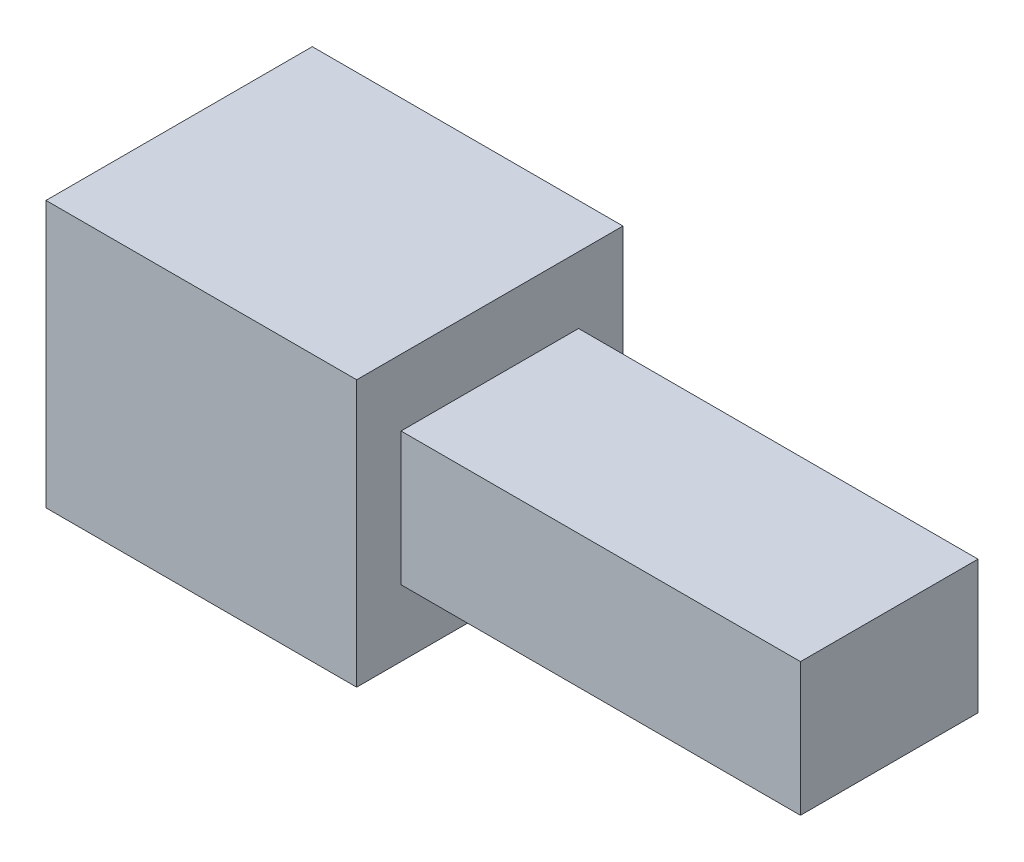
ISO-10303-21;
HEADER;
FILE_DESCRIPTION(('STEP AP214'),'2;1');
FILE_NAME('part.step','',(''),(''),'','','');
FILE_SCHEMA(('AUTOMOTIVE_DESIGN { 1 0 10303 214 1 1 1 1 }'));
ENDSEC;
DATA;
#1=APPLICATION_CONTEXT('core data for automotive mechanical design processes');
#2=APPLICATION_PROTOCOL_DEFINITION('international standard','automotive_design',2000,#1);
#3=PRODUCT_CONTEXT('',#1,'mechanical');
#4=PRODUCT('Part','Part','',(#3));
#5=PRODUCT_RELATED_PRODUCT_CATEGORY('part','',(#4));
#6=PRODUCT_DEFINITION_FORMATION('','',#4);
#7=PRODUCT_DEFINITION_CONTEXT('part definition',#1,'design');
#8=PRODUCT_DEFINITION('design','',#6,#7);
#9=PRODUCT_DEFINITION_SHAPE('','',#8);
#10=(LENGTH_UNIT() NAMED_UNIT(*) SI_UNIT(.MILLI.,.METRE.));
#11=(NAMED_UNIT(*) PLANE_ANGLE_UNIT() SI_UNIT($,.RADIAN.));
#12=(NAMED_UNIT(*) SI_UNIT($,.STERADIAN.) SOLID_ANGLE_UNIT());
#13=UNCERTAINTY_MEASURE_WITH_UNIT(LENGTH_MEASURE(1.E-05),#10,'distance_accuracy_value','');
#14=(GEOMETRIC_REPRESENTATION_CONTEXT(3) GLOBAL_UNCERTAINTY_ASSIGNED_CONTEXT((#13)) GLOBAL_UNIT_ASSIGNED_CONTEXT((#10,
#11,#12)) REPRESENTATION_CONTEXT('',''));
#15=CARTESIAN_POINT('',(0.,0.,0.));
#16=DIRECTION('',(0.,0.,1.));
#17=DIRECTION('',(1.,0.,0.));
#18=AXIS2_PLACEMENT_3D('',#15,#16,#17);
#19=CARTESIAN_POINT('',(10.,1.5,-2.));
#20=DIRECTION('',(0.,0.,1.));
#21=DIRECTION('',(1.,0.,0.));
#22=AXIS2_PLACEMENT_3D('',#19,#20,#21);
#23=PLANE('',#22);
#24=DIRECTION('',(0.,-1.,0.));
#25=VECTOR('',#24,1.);
#26=CARTESIAN_POINT('',(0.999999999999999,1.5,-2.));
#27=LINE('',#26,#25);
#28=CARTESIAN_POINT('',(0.999999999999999,1.5,-2.));
#29=VERTEX_POINT('',#28);
#30=CARTESIAN_POINT('',(0.999999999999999,-1.5,-2.));
#31=VERTEX_POINT('',#30);
#32=EDGE_CURVE('E182',#29,#31,#27,.T.);
#33=ORIENTED_EDGE('',*,*,#32,.F.);
#34=DIRECTION('',(-1.,0.,0.));
#35=VECTOR('',#34,1.);
#36=CARTESIAN_POINT('',(10.,1.5,-2.));
#37=LINE('',#36,#35);
#38=CARTESIAN_POINT('',(10.,1.5,-2.));
#39=VERTEX_POINT('',#38);
#40=EDGE_CURVE('E203',#39,#29,#37,.T.);
#41=ORIENTED_EDGE('',*,*,#40,.F.);
#42=DIRECTION('',(0.,1.,0.));
#43=VECTOR('',#42,1.);
#44=CARTESIAN_POINT('',(10.,1.5,-2.));
#45=LINE('',#44,#43);
#46=CARTESIAN_POINT('',(10.,-1.5,-2.));
#47=VERTEX_POINT('',#46);
#48=EDGE_CURVE('E185',#47,#39,#45,.T.);
#49=ORIENTED_EDGE('',*,*,#48,.F.);
#50=DIRECTION('',(-1.,0.,0.));
#51=VECTOR('',#50,1.);
#52=CARTESIAN_POINT('',(10.,-1.5,-2.));
#53=LINE('',#52,#51);
#54=EDGE_CURVE('E192',#47,#31,#53,.T.);
#55=ORIENTED_EDGE('',*,*,#54,.T.);
#56=EDGE_LOOP('',(#33,#41,#49,#55));
#57=FACE_BOUND('',#56,.T.);
#58=ADVANCED_FACE('F33',(#57),#23,.F.);
#59=CARTESIAN_POINT('',(10.,1.5,2.));
#60=DIRECTION('',(0.,-1.,0.));
#61=DIRECTION('',(0.,0.,-1.));
#62=AXIS2_PLACEMENT_3D('',#59,#60,#61);
#63=PLANE('',#62);
#64=DIRECTION('',(0.,0.,-1.));
#65=VECTOR('',#64,1.);
#66=CARTESIAN_POINT('',(0.999999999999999,1.5,2.));
#67=LINE('',#66,#65);
#68=CARTESIAN_POINT('',(0.999999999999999,1.5,2.));
#69=VERTEX_POINT('',#68);
#70=EDGE_CURVE('E179',#69,#29,#67,.T.);
#71=ORIENTED_EDGE('',*,*,#70,.F.);
#72=DIRECTION('',(-1.,0.,0.));
#73=VECTOR('',#72,1.);
#74=CARTESIAN_POINT('',(10.,1.5,2.));
#75=LINE('',#74,#73);
#76=CARTESIAN_POINT('',(10.,1.5,2.));
#77=VERTEX_POINT('',#76);
#78=EDGE_CURVE('E200',#77,#69,#75,.T.);
#79=ORIENTED_EDGE('',*,*,#78,.F.);
#80=DIRECTION('',(0.,0.,1.));
#81=VECTOR('',#80,1.);
#82=CARTESIAN_POINT('',(10.,1.5,2.));
#83=LINE('',#82,#81);
#84=EDGE_CURVE('E187',#39,#77,#83,.T.);
#85=ORIENTED_EDGE('',*,*,#84,.F.);
#86=ORIENTED_EDGE('',*,*,#40,.T.);
#87=EDGE_LOOP('',(#71,#79,#85,#86));
#88=FACE_BOUND('',#87,.T.);
#89=ADVANCED_FACE('F230',(#88),#63,.F.);
#90=CARTESIAN_POINT('',(10.,1.5,2.));
#91=DIRECTION('',(0.,0.,-1.));
#92=DIRECTION('',(0.,1.,0.));
#93=AXIS2_PLACEMENT_3D('',#90,#91,#92);
#94=PLANE('',#93);
#95=DIRECTION('',(0.,1.,0.));
#96=VECTOR('',#95,1.);
#97=CARTESIAN_POINT('',(0.999999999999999,1.5,2.));
#98=LINE('',#97,#96);
#99=CARTESIAN_POINT('',(0.999999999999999,-1.5,2.));
#100=VERTEX_POINT('',#99);
#101=EDGE_CURVE('E177',#100,#69,#98,.T.);
#102=ORIENTED_EDGE('',*,*,#101,.F.);
#103=DIRECTION('',(-1.,0.,0.));
#104=VECTOR('',#103,1.);
#105=CARTESIAN_POINT('',(10.,-1.5,2.));
#106=LINE('',#105,#104);
#107=CARTESIAN_POINT('',(10.,-1.5,2.));
#108=VERTEX_POINT('',#107);
#109=EDGE_CURVE('E197',#108,#100,#106,.T.);
#110=ORIENTED_EDGE('',*,*,#109,.F.);
#111=DIRECTION('',(0.,-1.,0.));
#112=VECTOR('',#111,1.);
#113=CARTESIAN_POINT('',(10.,1.5,2.));
#114=LINE('',#113,#112);
#115=EDGE_CURVE('E189',#77,#108,#114,.T.);
#116=ORIENTED_EDGE('',*,*,#115,.F.);
#117=ORIENTED_EDGE('',*,*,#78,.T.);
#118=EDGE_LOOP('',(#102,#110,#116,#117));
#119=FACE_BOUND('',#118,.T.);
#120=ADVANCED_FACE('F220',(#119),#94,.F.);
#121=CARTESIAN_POINT('',(10.,-1.5,2.));
#122=DIRECTION('',(0.,1.,0.));
#123=DIRECTION('',(0.,0.,1.));
#124=AXIS2_PLACEMENT_3D('',#121,#122,#123);
#125=PLANE('',#124);
#126=DIRECTION('',(0.,0.,1.));
#127=VECTOR('',#126,1.);
#128=CARTESIAN_POINT('',(0.999999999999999,-1.5,2.));
#129=LINE('',#128,#127);
#130=CARTESIAN_POINT('',(1.,-1.5,-1.32287565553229));
#131=VERTEX_POINT('',#130);
#132=EDGE_CURVE('E11',#31,#131,#129,.T.);
#133=ORIENTED_EDGE('',*,*,#132,.F.);
#134=ORIENTED_EDGE('',*,*,#54,.F.);
#135=DIRECTION('',(0.,0.,-1.));
#136=VECTOR('',#135,1.);
#137=CARTESIAN_POINT('',(10.,-1.5,2.));
#138=LINE('',#137,#136);
#139=EDGE_CURVE('E55',#108,#47,#138,.T.);
#140=ORIENTED_EDGE('',*,*,#139,.F.);
#141=ORIENTED_EDGE('',*,*,#109,.T.);
#142=CARTESIAN_POINT('',(1.,-1.5,1.32287565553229));
#143=VERTEX_POINT('',#142);
#144=EDGE_CURVE('E36',#143,#100,#129,.T.);
#145=ORIENTED_EDGE('',*,*,#144,.F.);
#146=DIRECTION('',(-1.,0.,0.));
#147=VECTOR('',#146,1.);
#148=CARTESIAN_POINT('',(1.,-1.5,1.32287565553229));
#149=LINE('',#148,#147);
#150=CARTESIAN_POINT('',(0.,-1.5,1.32287565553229));
#151=VERTEX_POINT('',#150);
#152=EDGE_CURVE('E174',#143,#151,#149,.T.);
#153=ORIENTED_EDGE('',*,*,#152,.T.);
#154=DIRECTION('',(0.,0.,-1.));
#155=VECTOR('',#154,1.);
#156=CARTESIAN_POINT('',(0.,-1.5,2.));
#157=LINE('',#156,#155);
#158=CARTESIAN_POINT('',(0.,-1.5,-1.32287565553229));
#159=VERTEX_POINT('',#158);
#160=EDGE_CURVE('E184',#151,#159,#157,.T.);
#161=ORIENTED_EDGE('',*,*,#160,.T.);
#162=DIRECTION('',(-1.,0.,0.));
#163=VECTOR('',#162,1.);
#164=CARTESIAN_POINT('',(1.,-1.5,-1.32287565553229));
#165=LINE('',#164,#163);
#166=EDGE_CURVE('E171',#159,#131,#165,.F.);
#167=ORIENTED_EDGE('',*,*,#166,.T.);
#168=EDGE_LOOP('',(#133,#134,#140,#141,#145,#153,#161,#167));
#169=FACE_BOUND('',#168,.T.);
#170=ADVANCED_FACE('F224',(#169),#125,.F.);
#171=CARTESIAN_POINT('',(10.,0.,0.));
#172=DIRECTION('',(1.,0.,0.));
#173=DIRECTION('',(0.,0.,-1.));
#174=AXIS2_PLACEMENT_3D('',#171,#172,#173);
#175=PLANE('',#174);
#176=ORIENTED_EDGE('',*,*,#48,.T.);
#177=ORIENTED_EDGE('',*,*,#84,.T.);
#178=ORIENTED_EDGE('',*,*,#115,.T.);
#179=ORIENTED_EDGE('',*,*,#139,.T.);
#180=EDGE_LOOP('',(#176,#177,#178,#179));
#181=FACE_BOUND('',#180,.T.);
#182=ADVANCED_FACE('F228',(#181),#175,.T.);
#183=CARTESIAN_POINT('',(0.,0.,0.));
#184=DIRECTION('',(1.,0.,0.));
#185=DIRECTION('',(0.,0.,-1.));
#186=AXIS2_PLACEMENT_3D('',#183,#184,#185);
#187=PLANE('',#186);
#188=CARTESIAN_POINT('',(0.,0.,0.));
#189=DIRECTION('',(1.,0.,0.));
#190=DIRECTION('',(0.,0.,-1.));
#191=AXIS2_PLACEMENT_3D('',#188,#189,#190);
#192=CIRCLE('',#191,2.);
#193=CARTESIAN_POINT('',(0.,1.46,-1.36689428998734));
#194=VERTEX_POINT('',#193);
#195=EDGE_CURVE('E126',#194,#159,#192,.F.);
#196=ORIENTED_EDGE('',*,*,#195,.T.);
#197=ORIENTED_EDGE('',*,*,#160,.F.);
#198=CARTESIAN_POINT('',(0.,1.46,1.36689428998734));
#199=VERTEX_POINT('',#198);
#200=EDGE_CURVE('E207',#151,#199,#192,.F.);
#201=ORIENTED_EDGE('',*,*,#200,.T.);
#202=DIRECTION('',(0.,0.,-1.));
#203=VECTOR('',#202,1.);
#204=CARTESIAN_POINT('',(0.,1.46,0.));
#205=LINE('',#204,#203);
#206=EDGE_CURVE('E206',#199,#194,#205,.T.);
#207=ORIENTED_EDGE('',*,*,#206,.T.);
#208=EDGE_LOOP('',(#196,#197,#201,#207));
#209=FACE_BOUND('',#208,.T.);
#210=ADVANCED_FACE('F231',(#209),#187,.F.);
#211=CARTESIAN_POINT('',(1.,0.,0.));
#212=DIRECTION('',(-1.,0.,0.));
#213=DIRECTION('',(0.,0.,1.));
#214=AXIS2_PLACEMENT_3D('',#211,#212,#213);
#215=PLANE('',#214);
#216=DIRECTION('',(0.,-1.,0.));
#217=VECTOR('',#216,1.);
#218=CARTESIAN_POINT('',(1.,3.,3.));
#219=LINE('',#218,#217);
#220=CARTESIAN_POINT('',(1.,3.,3.));
#221=VERTEX_POINT('',#220);
#222=CARTESIAN_POINT('',(1.,-3.,3.));
#223=VERTEX_POINT('',#222);
#224=EDGE_CURVE('E128',#221,#223,#219,.T.);
#225=ORIENTED_EDGE('',*,*,#224,.T.);
#226=DIRECTION('',(0.,0.,-1.));
#227=VECTOR('',#226,1.);
#228=CARTESIAN_POINT('',(1.,-3.,-3.));
#229=LINE('',#228,#227);
#230=CARTESIAN_POINT('',(1.,-3.,-3.));
#231=VERTEX_POINT('',#230);
#232=EDGE_CURVE('E157',#223,#231,#229,.T.);
#233=ORIENTED_EDGE('',*,*,#232,.T.);
#234=DIRECTION('',(0.,1.,0.));
#235=VECTOR('',#234,1.);
#236=CARTESIAN_POINT('',(1.,3.,-3.));
#237=LINE('',#236,#235);
#238=CARTESIAN_POINT('',(1.,3.,-3.));
#239=VERTEX_POINT('',#238);
#240=EDGE_CURVE('E159',#231,#239,#237,.T.);
#241=ORIENTED_EDGE('',*,*,#240,.T.);
#242=DIRECTION('',(0.,0.,1.));
#243=VECTOR('',#242,1.);
#244=CARTESIAN_POINT('',(1.,3.,-3.));
#245=LINE('',#244,#243);
#246=EDGE_CURVE('E161',#239,#221,#245,.T.);
#247=ORIENTED_EDGE('',*,*,#246,.T.);
#248=EDGE_LOOP('',(#225,#233,#241,#247));
#249=FACE_BOUND('',#248,.T.);
#250=ORIENTED_EDGE('',*,*,#32,.T.);
#251=ORIENTED_EDGE('',*,*,#132,.T.);
#252=CARTESIAN_POINT('',(1.,0.,0.));
#253=DIRECTION('',(1.,0.,0.));
#254=DIRECTION('',(0.,0.,-1.));
#255=AXIS2_PLACEMENT_3D('',#252,#253,#254);
#256=CIRCLE('',#255,2.);
#257=EDGE_CURVE('E151',#143,#131,#256,.T.);
#258=ORIENTED_EDGE('',*,*,#257,.F.);
#259=ORIENTED_EDGE('',*,*,#144,.T.);
#260=ORIENTED_EDGE('',*,*,#101,.T.);
#261=ORIENTED_EDGE('',*,*,#70,.T.);
#262=EDGE_LOOP('',(#250,#251,#258,#259,#260,#261));
#263=FACE_BOUND('',#262,.T.);
#264=ADVANCED_FACE('F215',(#249,#263),#215,.F.);
#265=CARTESIAN_POINT('',(1.,0.,0.));
#266=DIRECTION('',(-1.,0.,0.));
#267=DIRECTION('',(0.,0.,1.));
#268=AXIS2_PLACEMENT_3D('',#265,#266,#267);
#269=CYLINDRICAL_SURFACE('',#268,2.);
#270=ORIENTED_EDGE('',*,*,#152,.F.);
#271=ORIENTED_EDGE('',*,*,#257,.T.);
#272=ORIENTED_EDGE('',*,*,#166,.F.);
#273=ORIENTED_EDGE('',*,*,#195,.F.);
#274=DIRECTION('',(-1.,0.,0.));
#275=VECTOR('',#274,1.);
#276=CARTESIAN_POINT('',(1.,1.46,-1.36689428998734));
#277=LINE('',#276,#275);
#278=CARTESIAN_POINT('',(-6.,1.46,-1.36689428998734));
#279=VERTEX_POINT('',#278);
#280=EDGE_CURVE('E47',#194,#279,#277,.T.);
#281=ORIENTED_EDGE('',*,*,#280,.T.);
#282=CARTESIAN_POINT('',(-6.,0.,0.));
#283=DIRECTION('',(1.,0.,0.));
#284=DIRECTION('',(0.,0.,-1.));
#285=AXIS2_PLACEMENT_3D('',#282,#283,#284);
#286=CIRCLE('',#285,2.);
#287=CARTESIAN_POINT('',(-6.,1.46,1.36689428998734));
#288=VERTEX_POINT('',#287);
#289=EDGE_CURVE('E123',#288,#279,#286,.T.);
#290=ORIENTED_EDGE('',*,*,#289,.F.);
#291=DIRECTION('',(-1.,0.,0.));
#292=VECTOR('',#291,1.);
#293=CARTESIAN_POINT('',(1.,1.46,1.36689428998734));
#294=LINE('',#293,#292);
#295=EDGE_CURVE('E129',#199,#288,#294,.T.);
#296=ORIENTED_EDGE('',*,*,#295,.F.);
#297=ORIENTED_EDGE('',*,*,#200,.F.);
#298=EDGE_LOOP('',(#270,#271,#272,#273,#281,#290,#296,#297));
#299=FACE_BOUND('',#298,.T.);
#300=ADVANCED_FACE('F120',(#299),#269,.F.);
#301=CARTESIAN_POINT('',(1.,1.46,-1.36689428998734));
#302=DIRECTION('',(0.,-1.,0.));
#303=DIRECTION('',(0.,0.,-1.));
#304=AXIS2_PLACEMENT_3D('',#301,#302,#303);
#305=PLANE('',#304);
#306=ORIENTED_EDGE('',*,*,#206,.F.);
#307=ORIENTED_EDGE('',*,*,#295,.T.);
#308=DIRECTION('',(0.,0.,1.));
#309=VECTOR('',#308,1.);
#310=CARTESIAN_POINT('',(-6.,1.46,-1.36689428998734));
#311=LINE('',#310,#309);
#312=EDGE_CURVE('E131',#279,#288,#311,.T.);
#313=ORIENTED_EDGE('',*,*,#312,.F.);
#314=ORIENTED_EDGE('',*,*,#280,.F.);
#315=EDGE_LOOP('',(#306,#307,#313,#314));
#316=FACE_BOUND('',#315,.T.);
#317=ADVANCED_FACE('F132',(#316),#305,.T.);
#318=CARTESIAN_POINT('',(1.,3.,3.));
#319=DIRECTION('',(0.,0.,-1.));
#320=DIRECTION('',(0.,1.,0.));
#321=AXIS2_PLACEMENT_3D('',#318,#319,#320);
#322=PLANE('',#321);
#323=DIRECTION('',(-1.,0.,0.));
#324=VECTOR('',#323,1.);
#325=CARTESIAN_POINT('',(1.,3.,3.));
#326=LINE('',#325,#324);
#327=CARTESIAN_POINT('',(-6.,3.,3.));
#328=VERTEX_POINT('',#327);
#329=EDGE_CURVE('E163',#221,#328,#326,.T.);
#330=ORIENTED_EDGE('',*,*,#329,.T.);
#331=DIRECTION('',(0.,-1.,0.));
#332=VECTOR('',#331,1.);
#333=CARTESIAN_POINT('',(-6.,3.,3.));
#334=LINE('',#333,#332);
#335=CARTESIAN_POINT('',(-6.,-3.,3.));
#336=VERTEX_POINT('',#335);
#337=EDGE_CURVE('E134',#328,#336,#334,.T.);
#338=ORIENTED_EDGE('',*,*,#337,.T.);
#339=DIRECTION('',(-1.,0.,0.));
#340=VECTOR('',#339,1.);
#341=CARTESIAN_POINT('',(1.,-3.,3.));
#342=LINE('',#341,#340);
#343=EDGE_CURVE('E169',#223,#336,#342,.T.);
#344=ORIENTED_EDGE('',*,*,#343,.F.);
#345=ORIENTED_EDGE('',*,*,#224,.F.);
#346=EDGE_LOOP('',(#330,#338,#344,#345));
#347=FACE_BOUND('',#346,.T.);
#348=ADVANCED_FACE('F300',(#347),#322,.F.);
#349=CARTESIAN_POINT('',(1.,-3.,-3.));
#350=DIRECTION('',(0.,1.,0.));
#351=DIRECTION('',(0.,0.,1.));
#352=AXIS2_PLACEMENT_3D('',#349,#350,#351);
#353=PLANE('',#352);
#354=ORIENTED_EDGE('',*,*,#343,.T.);
#355=DIRECTION('',(0.,0.,-1.));
#356=VECTOR('',#355,1.);
#357=CARTESIAN_POINT('',(-6.,-3.,-3.));
#358=LINE('',#357,#356);
#359=CARTESIAN_POINT('',(-6.,-3.,-3.));
#360=VERTEX_POINT('',#359);
#361=EDGE_CURVE('E142',#336,#360,#358,.T.);
#362=ORIENTED_EDGE('',*,*,#361,.T.);
#363=DIRECTION('',(-1.,0.,0.));
#364=VECTOR('',#363,1.);
#365=CARTESIAN_POINT('',(1.,-3.,-3.));
#366=LINE('',#365,#364);
#367=EDGE_CURVE('E167',#231,#360,#366,.T.);
#368=ORIENTED_EDGE('',*,*,#367,.F.);
#369=ORIENTED_EDGE('',*,*,#232,.F.);
#370=EDGE_LOOP('',(#354,#362,#368,#369));
#371=FACE_BOUND('',#370,.T.);
#372=ADVANCED_FACE('F309',(#371),#353,.F.);
#373=CARTESIAN_POINT('',(1.,3.,-3.));
#374=DIRECTION('',(0.,0.,1.));
#375=DIRECTION('',(0.,-1.,0.));
#376=AXIS2_PLACEMENT_3D('',#373,#374,#375);
#377=PLANE('',#376);
#378=ORIENTED_EDGE('',*,*,#367,.T.);
#379=DIRECTION('',(0.,1.,0.));
#380=VECTOR('',#379,1.);
#381=CARTESIAN_POINT('',(-6.,3.,-3.));
#382=LINE('',#381,#380);
#383=CARTESIAN_POINT('',(-6.,3.,-3.));
#384=VERTEX_POINT('',#383);
#385=EDGE_CURVE('E145',#360,#384,#382,.T.);
#386=ORIENTED_EDGE('',*,*,#385,.T.);
#387=DIRECTION('',(-1.,0.,0.));
#388=VECTOR('',#387,1.);
#389=CARTESIAN_POINT('',(1.,3.,-3.));
#390=LINE('',#389,#388);
#391=EDGE_CURVE('E165',#239,#384,#390,.T.);
#392=ORIENTED_EDGE('',*,*,#391,.F.);
#393=ORIENTED_EDGE('',*,*,#240,.F.);
#394=EDGE_LOOP('',(#378,#386,#392,#393));
#395=FACE_BOUND('',#394,.T.);
#396=ADVANCED_FACE('F319',(#395),#377,.F.);
#397=CARTESIAN_POINT('',(1.,3.,-3.));
#398=DIRECTION('',(0.,-1.,0.));
#399=DIRECTION('',(0.,0.,-1.));
#400=AXIS2_PLACEMENT_3D('',#397,#398,#399);
#401=PLANE('',#400);
#402=ORIENTED_EDGE('',*,*,#391,.T.);
#403=DIRECTION('',(0.,0.,1.));
#404=VECTOR('',#403,1.);
#405=CARTESIAN_POINT('',(-6.,3.,-3.));
#406=LINE('',#405,#404);
#407=EDGE_CURVE('E148',#384,#328,#406,.T.);
#408=ORIENTED_EDGE('',*,*,#407,.T.);
#409=ORIENTED_EDGE('',*,*,#329,.F.);
#410=ORIENTED_EDGE('',*,*,#246,.F.);
#411=EDGE_LOOP('',(#402,#408,#409,#410));
#412=FACE_BOUND('',#411,.T.);
#413=ADVANCED_FACE('F329',(#412),#401,.F.);
#414=CARTESIAN_POINT('',(-6.,0.,0.));
#415=DIRECTION('',(-1.,0.,0.));
#416=DIRECTION('',(0.,0.,1.));
#417=AXIS2_PLACEMENT_3D('',#414,#415,#416);
#418=PLANE('',#417);
#419=ORIENTED_EDGE('',*,*,#289,.T.);
#420=ORIENTED_EDGE('',*,*,#312,.T.);
#421=EDGE_LOOP('',(#419,#420));
#422=FACE_BOUND('',#421,.T.);
#423=ORIENTED_EDGE('',*,*,#337,.F.);
#424=ORIENTED_EDGE('',*,*,#407,.F.);
#425=ORIENTED_EDGE('',*,*,#385,.F.);
#426=ORIENTED_EDGE('',*,*,#361,.F.);
#427=EDGE_LOOP('',(#423,#424,#425,#426));
#428=FACE_BOUND('',#427,.T.);
#429=ADVANCED_FACE('F136',(#422,#428),#418,.T.);
#430=CLOSED_SHELL('',(#58,#89,#120,#170,#182,#210,#264,#300,#317,#348,#372,#396,#413,#429));
#431=MANIFOLD_SOLID_BREP('B2',#430);
#432=ADVANCED_BREP_SHAPE_REPRESENTATION('',(#18,#431),#14);
#433=SHAPE_DEFINITION_REPRESENTATION(#9,#432);
ENDSEC;
END-ISO-10303-21;
